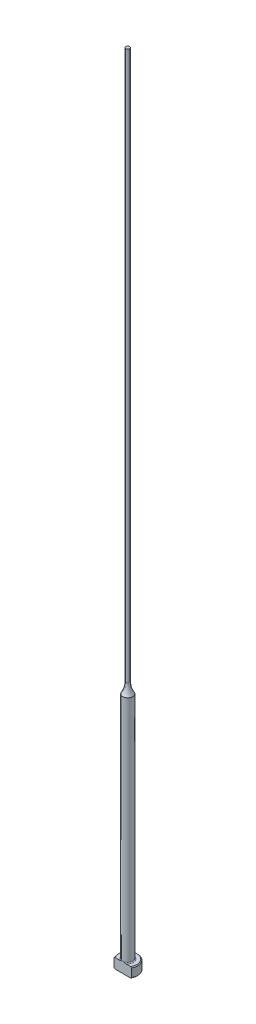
from build123d import *

# Parameters (mm, degrees)
CHAMFER1_SIZE = 0.254
FILLET1_R     = 0.254
KEY_DEPTH     = 255.0396844


with BuildPart() as part:
    # Sketch1 → Revolve1 (revolve)
    with BuildSketch(Plane.XY, mode=Mode.PRIVATE) as revolve1_sk:
        with BuildLine():
            Line((0, 0), (-3.175, 0))
            Line((-3.175, 0), (-3.175, 3.175))
            Line((-3.175, 3.175), (-1.5875, 3.175))
            Line((-1.5875, 3.175), (-1.5875, 76.2))
            ThreePointArc((-1.5875, 76.2), (-0.847698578, 77.834042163), (-0.59436, 79.609772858))
            Line((-0.59436, 79.609772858), (-0.59436, 254))
            Line((-0.59436, 254), (0, 254))
            Line((0, 254), (0, 0))
        make_face()
    revolve(revolve1_sk.sketch.rotate(Axis((0, 259.958771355, 0), (0, -1, 0)), 270), axis=Axis((0, 259.958771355, 0), (0, -1, 0)))

    # Chamfer1
    chamfer1_edges = [part.edges().sort_by_distance(p)[0] for p in [
        (0, 0, -3.175),
        (0, 3.175, -3.175),
    ]]
    chamfer(chamfer1_edges, length=CHAMFER1_SIZE)

    # Fillet1
    fillet1_edges = [part.edges().sort_by_distance(p)[0] for p in [
        (0, 3.175, -1.5875),
    ]]
    fillet(fillet1_edges, radius=FILLET1_R)

    # Sketch2 → KEY (cut, through all)
    with BuildSketch(Plane.XZ):
        with BuildLine():
            Line((-2.749630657, 1.5875), (2.749630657, 1.5875))
            ThreePointArc((2.749630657, 1.5875), (0, 3.175), (-2.749630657, 1.5875))
        make_face()
    extrude(amount=-KEY_DEPTH, mode=Mode.SUBTRACT)


solid = part.part
